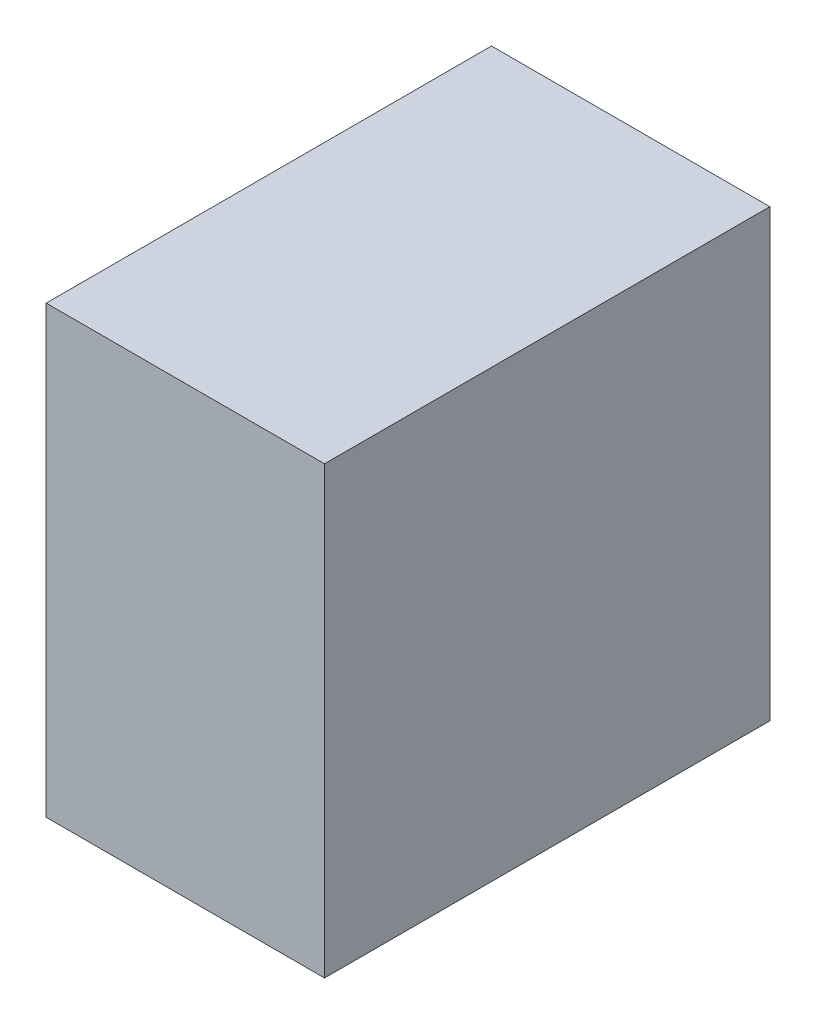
from build123d import *

# Parameters (mm, degrees)
SKETCH2_W           = 19.05
SKETCH2_H           = 30.48
BOSS_EXTRUDE1_DEPTH = 30.48
SKETCH3_R           = 1.719086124
CUT_EXTRUDE1_DEPTH  = 1.27


with BuildPart() as part:
    # Sketch2 → Boss-Extrude1 (new body)
    with BuildSketch(Plane(origin=(0, 0, 0), x_dir=(1, 0, 0), z_dir=(0, 1, 0))):
        with Locations((9.525, 15.24)):
            Rectangle(SKETCH2_W, SKETCH2_H)
    extrude(amount=BOSS_EXTRUDE1_DEPTH)

    # Sketch3 → Cut-Extrude1 (cut)
    with BuildSketch(Plane(origin=(0, 0, -30.48), x_dir=(-1, 0, 0), z_dir=(0, 0, -1))):
        with Locations((-9.525, 26.212693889)):
            Circle(SKETCH3_R)
    extrude(amount=-CUT_EXTRUDE1_DEPTH, mode=Mode.SUBTRACT)


solid = part.part
